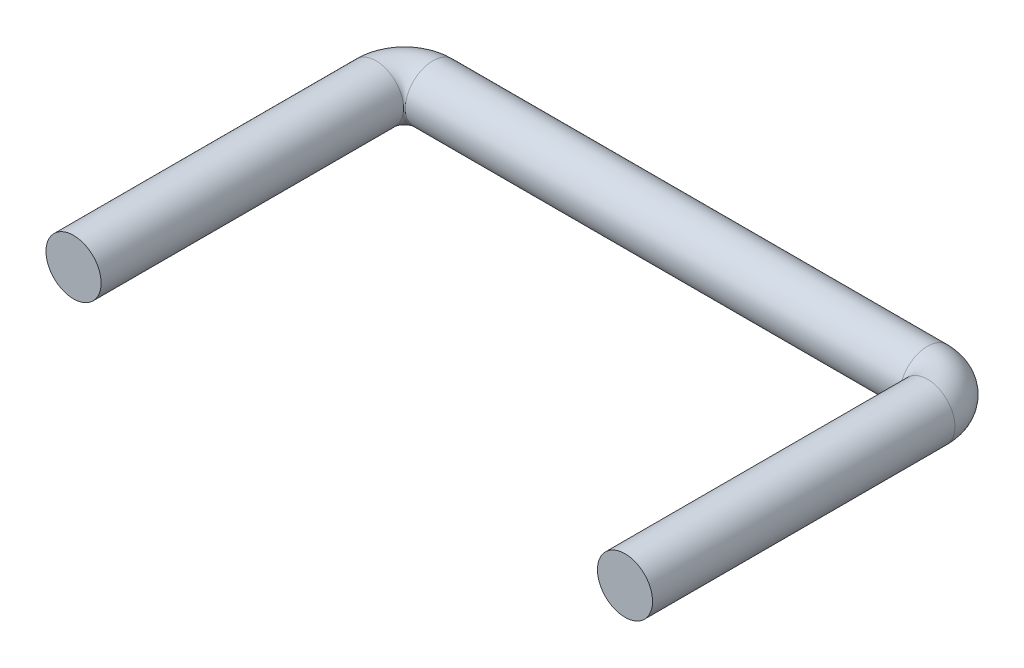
from build123d import *

# Parameters (mm, degrees)
SKETCH2_R = 0.79375


with BuildPart() as part:
    # Sweep1: sweep along a curve in space
    with BuildLine() as sweep1_path:
        Line((-26.973724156, 0, -28.655198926), (-26.973724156, 0, -37.363588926))
        ThreePointArc((-26.973724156, 0, -37.363588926), (-26.734544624, 0, -37.941019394), (-26.157114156, 0, -38.180198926))
        Line((-26.157114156, 0, -38.180198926), (-11.915334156, 0, -38.180198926))
        ThreePointArc((-11.915334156, 0, -38.180198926), (-11.337903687, 0, -37.941019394), (-11.098724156, 0, -37.363588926))
        Line((-11.098724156, 0, -37.363588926), (-11.098724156, 0, -28.655198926))
    # Sketch2 → Sweep1 (sweep)
    with BuildSketch(Plane(origin=(-26.973724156, 0, -28.655198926), x_dir=(-1, 0, 0), z_dir=(0, 0, -1))):
        with Locations((0.002576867, 0)):
            Circle(SKETCH2_R)
    sweep(path=sweep1_path.line)


solid = part.part
